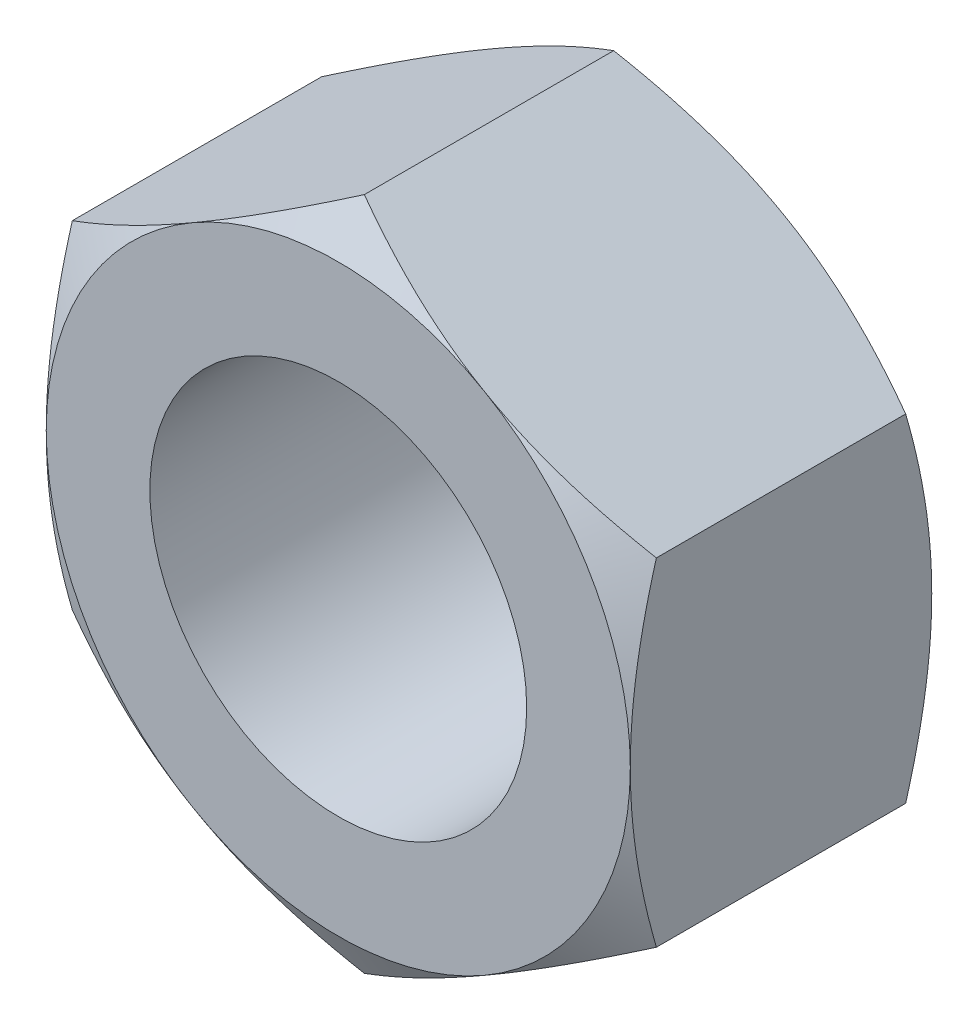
from build123d import *

# Parameters (mm, degrees)
SKETCH1_R               = 15.875
EXTRUDE1_DEPTH          = 12.7
SKETCH7_OUTSIDE_W       = 155.07
SKETCH7_OUTSIDE_H       = 162.684
SKETCH7_OUTSIDE_R       = 24.60625
EXTRUDE2_DEPTH          = 25.4
EXTRUDE2_DRAFT          = -60
MIRROR1_COPY_1_SKETCH_W = 155.07
MIRROR1_COPY_1_SKETCH_H = 162.684
MIRROR1_COPY_1_SKETCH_R = 24.60625
MIRROR1_COPY_1_DEPTH    = 25.4
MIRROR1_COPY_1_DRAFT    = -60


with BuildPart() as part:
    # Sketch1 → Extrude1 (new, symmetric)
    with BuildSketch(Plane.XY):
        Polygon((-24.60625, 14.206425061), (-24.60625, -14.206425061), (0, -28.412850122), (24.60625, -14.206425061), (24.60625, 14.206425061), (0, 28.412850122), align=None)
        Circle(SKETCH1_R, mode=Mode.SUBTRACT)
    extrude(amount=EXTRUDE1_DEPTH, both=True)


with BuildPart() as extrude2_tool:
    # Sketch7 outside → Extrude2 (with draft: the straight prism first)
    with BuildSketch(Plane.XY.offset(12.7)):
        Rectangle(SKETCH7_OUTSIDE_W, SKETCH7_OUTSIDE_H)
        Circle(SKETCH7_OUTSIDE_R, mode=Mode.SUBTRACT)
    extrude(amount=-EXTRUDE2_DEPTH)
    # Extrude2: the draft: its side faces are tilted about the plane it starts from
    extrude2_sides = [extrude2_tool.faces().sort_by_distance(p)[0] for p in [
        (0, -81.342, 0),
        (77.535, 0, 0),
        (0, 81.342, 0),
        (-77.535, 0, 0),
        (-24.60625, 0, 0),
    ]]
    draft(extrude2_sides, Plane.XY.offset(12.7), EXTRUDE2_DRAFT)


with BuildPart() as part_1:
    add(part.part)

    # Extrude2: cut by extrude2_tool
    add(extrude2_tool.part, mode=Mode.SUBTRACT)


with BuildPart() as mirror1_copy_1_tool:
    # Mirror1 copy 1 sketch → Mirror1 copy 1 (with draft: the straight prism first)
    with BuildSketch(Plane(origin=(0, 0, -12.7), x_dir=(1, 0, 0), z_dir=(0, 0, -1))):
        Rectangle(MIRROR1_COPY_1_SKETCH_W, MIRROR1_COPY_1_SKETCH_H)
        Circle(MIRROR1_COPY_1_SKETCH_R, mode=Mode.SUBTRACT)
    extrude(amount=-MIRROR1_COPY_1_DEPTH)
    # Mirror1 copy 1: the draft: its side faces are tilted about the plane it starts from
    mirror1_copy_1_sides = [mirror1_copy_1_tool.faces().sort_by_distance(p)[0] for p in [
        (0, -81.342, 0),
        (77.535, 0, 0),
        (0, 81.342, 0),
        (-77.535, 0, 0),
        (-24.60625, 0, 0),
    ]]
    draft(mirror1_copy_1_sides, Plane(origin=(0, 0, -12.7), x_dir=(1, 0, 0), z_dir=(0, 0, -1)), MIRROR1_COPY_1_DRAFT)


with BuildPart() as part_2:
    add(part_1.part)

    # Mirror1 copy 1: cut by mirror1_copy_1_tool
    add(mirror1_copy_1_tool.part, mode=Mode.SUBTRACT)


solid = part_2.part
